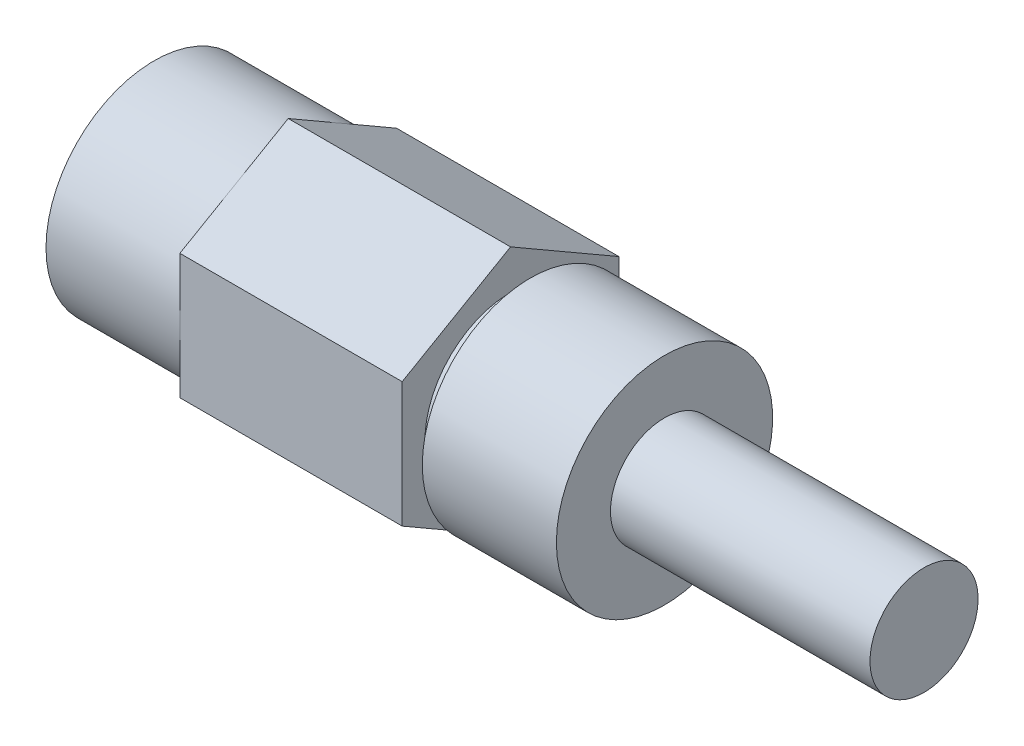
ISO-10303-21;
HEADER;
FILE_DESCRIPTION(('STEP AP214'),'2;1');
FILE_NAME('part.step','',(''),(''),'','','');
FILE_SCHEMA(('AUTOMOTIVE_DESIGN { 1 0 10303 214 1 1 1 1 }'));
ENDSEC;
DATA;
#1=APPLICATION_CONTEXT('core data for automotive mechanical design processes');
#2=APPLICATION_PROTOCOL_DEFINITION('international standard','automotive_design',2000,#1);
#3=PRODUCT_CONTEXT('',#1,'mechanical');
#4=PRODUCT('Part','Part','',(#3));
#5=PRODUCT_RELATED_PRODUCT_CATEGORY('part','',(#4));
#6=PRODUCT_DEFINITION_FORMATION('','',#4);
#7=PRODUCT_DEFINITION_CONTEXT('part definition',#1,'design');
#8=PRODUCT_DEFINITION('design','',#6,#7);
#9=PRODUCT_DEFINITION_SHAPE('','',#8);
#10=(LENGTH_UNIT() NAMED_UNIT(*) SI_UNIT(.MILLI.,.METRE.));
#11=(NAMED_UNIT(*) PLANE_ANGLE_UNIT() SI_UNIT($,.RADIAN.));
#12=(NAMED_UNIT(*) SI_UNIT($,.STERADIAN.) SOLID_ANGLE_UNIT());
#13=UNCERTAINTY_MEASURE_WITH_UNIT(LENGTH_MEASURE(1.E-05),#10,'distance_accuracy_value','');
#14=(GEOMETRIC_REPRESENTATION_CONTEXT(3) GLOBAL_UNCERTAINTY_ASSIGNED_CONTEXT((#13)) GLOBAL_UNIT_ASSIGNED_CONTEXT((#10,
#11,#12)) REPRESENTATION_CONTEXT('',''));
#15=CARTESIAN_POINT('',(0.,0.,0.));
#16=DIRECTION('',(0.,0.,1.));
#17=DIRECTION('',(1.,0.,0.));
#18=AXIS2_PLACEMENT_3D('',#15,#16,#17);
#19=CARTESIAN_POINT('',(0.,0.,0.));
#20=DIRECTION('',(-1.,0.,0.));
#21=DIRECTION('',(0.,0.,1.));
#22=AXIS2_PLACEMENT_3D('',#19,#20,#21);
#23=CYLINDRICAL_SURFACE('',#22,6.35);
#24=CARTESIAN_POINT('',(22.098,0.,0.));
#25=DIRECTION('',(-1.,0.,0.));
#26=DIRECTION('',(0.,0.,1.));
#27=AXIS2_PLACEMENT_3D('',#24,#25,#26);
#28=CIRCLE('',#27,6.35);
#29=CARTESIAN_POINT('',(22.098,0.,6.35));
#30=VERTEX_POINT('',#29);
#31=EDGE_CURVE('E154',#30,#30,#28,.T.);
#32=ORIENTED_EDGE('',*,*,#31,.F.);
#33=EDGE_LOOP('',(#32));
#34=FACE_BOUND('',#33,.T.);
#35=CARTESIAN_POINT('',(29.972,0.,0.));
#36=DIRECTION('',(-1.,0.,0.));
#37=DIRECTION('',(0.,0.,1.));
#38=AXIS2_PLACEMENT_3D('',#35,#36,#37);
#39=CIRCLE('',#38,6.35);
#40=CARTESIAN_POINT('',(29.972,0.,6.35));
#41=VERTEX_POINT('',#40);
#42=EDGE_CURVE('E166',#41,#41,#39,.T.);
#43=ORIENTED_EDGE('',*,*,#42,.T.);
#44=EDGE_LOOP('',(#43));
#45=FACE_BOUND('',#44,.T.);
#46=ADVANCED_FACE('F38',(#34,#45),#23,.T.);
#47=CARTESIAN_POINT('',(29.972,6.35,0.));
#48=DIRECTION('',(-1.,0.,0.));
#49=DIRECTION('',(0.,0.,1.));
#50=AXIS2_PLACEMENT_3D('',#47,#48,#49);
#51=PLANE('',#50);
#52=ORIENTED_EDGE('',*,*,#42,.F.);
#53=EDGE_LOOP('',(#52));
#54=FACE_BOUND('',#53,.T.);
#55=CARTESIAN_POINT('',(29.972,0.,0.));
#56=DIRECTION('',(-1.,0.,0.));
#57=DIRECTION('',(0.,0.,1.));
#58=AXIS2_PLACEMENT_3D('',#55,#56,#57);
#59=CIRCLE('',#58,3.175);
#60=CARTESIAN_POINT('',(29.972,0.,3.175));
#61=VERTEX_POINT('',#60);
#62=EDGE_CURVE('E162',#61,#61,#59,.T.);
#63=ORIENTED_EDGE('',*,*,#62,.T.);
#64=EDGE_LOOP('',(#63));
#65=FACE_BOUND('',#64,.T.);
#66=ADVANCED_FACE('F237',(#54,#65),#51,.F.);
#67=CARTESIAN_POINT('',(0.,0.,0.));
#68=DIRECTION('',(-1.,0.,0.));
#69=DIRECTION('',(0.,0.,1.));
#70=AXIS2_PLACEMENT_3D('',#67,#68,#69);
#71=CYLINDRICAL_SURFACE('',#70,3.175);
#72=ORIENTED_EDGE('',*,*,#62,.F.);
#73=EDGE_LOOP('',(#72));
#74=FACE_BOUND('',#73,.T.);
#75=CARTESIAN_POINT('',(45.212,0.,0.));
#76=DIRECTION('',(-1.,0.,0.));
#77=DIRECTION('',(0.,0.,1.));
#78=AXIS2_PLACEMENT_3D('',#75,#76,#77);
#79=CIRCLE('',#78,3.175);
#80=CARTESIAN_POINT('',(45.212,0.,3.175));
#81=VERTEX_POINT('',#80);
#82=EDGE_CURVE('E158',#81,#81,#79,.T.);
#83=ORIENTED_EDGE('',*,*,#82,.T.);
#84=EDGE_LOOP('',(#83));
#85=FACE_BOUND('',#84,.T.);
#86=ADVANCED_FACE('F243',(#74,#85),#71,.T.);
#87=CARTESIAN_POINT('',(45.212,3.175,0.));
#88=DIRECTION('',(-1.,0.,0.));
#89=DIRECTION('',(0.,0.,1.));
#90=AXIS2_PLACEMENT_3D('',#87,#88,#89);
#91=PLANE('',#90);
#92=ORIENTED_EDGE('',*,*,#82,.F.);
#93=EDGE_LOOP('',(#92));
#94=FACE_BOUND('',#93,.T.);
#95=ADVANCED_FACE('F251',(#94),#91,.F.);
#96=CARTESIAN_POINT('',(22.098,7.34701311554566,0.));
#97=DIRECTION('',(-1.,0.,0.));
#98=DIRECTION('',(0.,0.,1.));
#99=AXIS2_PLACEMENT_3D('',#96,#97,#98);
#100=PLANE('',#99);
#101=CARTESIAN_POINT('',(22.098,0.,0.));
#102=DIRECTION('',(1.,0.,0.));
#103=DIRECTION('',(0.,0.,-1.));
#104=AXIS2_PLACEMENT_3D('',#101,#102,#103);
#105=CIRCLE('',#104,5.0292);
#106=CARTESIAN_POINT('',(22.098,0.,-5.0292));
#107=VERTEX_POINT('',#106);
#108=EDGE_CURVE('E215',#107,#107,#105,.T.);
#109=ORIENTED_EDGE('',*,*,#108,.T.);
#110=EDGE_LOOP('',(#109));
#111=FACE_BOUND('',#110,.T.);
#112=ORIENTED_EDGE('',*,*,#31,.T.);
#113=EDGE_LOOP('',(#112));
#114=FACE_BOUND('',#113,.T.);
#115=ADVANCED_FACE('F234',(#111,#114),#100,.T.);
#116=CARTESIAN_POINT('',(28.5893612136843,0.,0.));
#117=DIRECTION('',(1.,0.,0.));
#118=DIRECTION('',(0.,0.,-1.));
#119=AXIS2_PLACEMENT_3D('',#116,#117,#118);
#120=CYLINDRICAL_SURFACE('',#119,5.0292);
#121=CARTESIAN_POINT('',(20.9296,0.,0.));
#122=DIRECTION('',(1.,0.,0.));
#123=DIRECTION('',(0.,0.,-1.));
#124=AXIS2_PLACEMENT_3D('',#121,#122,#123);
#125=CIRCLE('',#124,5.0292);
#126=CARTESIAN_POINT('',(20.9296,0.,-5.0292));
#127=VERTEX_POINT('',#126);
#128=EDGE_CURVE('E221',#127,#127,#125,.T.);
#129=ORIENTED_EDGE('',*,*,#128,.T.);
#130=EDGE_LOOP('',(#129));
#131=FACE_BOUND('',#130,.T.);
#132=ORIENTED_EDGE('',*,*,#108,.F.);
#133=EDGE_LOOP('',(#132));
#134=FACE_BOUND('',#133,.T.);
#135=ADVANCED_FACE('F226',(#131,#134),#120,.T.);
#136=CARTESIAN_POINT('',(20.9296,7.34701311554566,0.));
#137=DIRECTION('',(1.,0.,0.));
#138=DIRECTION('',(0.,0.,-1.));
#139=AXIS2_PLACEMENT_3D('',#136,#137,#138);
#140=PLANE('',#139);
#141=DIRECTION('',(0.,1.,0.));
#142=VECTOR('',#141,1.);
#143=CARTESIAN_POINT('',(20.9296,3.67350655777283,6.3627));
#144=LINE('',#143,#142);
#145=CARTESIAN_POINT('',(20.9296,-3.67350655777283,6.3627));
#146=VERTEX_POINT('',#145);
#147=CARTESIAN_POINT('',(20.9296,3.67350655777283,6.3627));
#148=VERTEX_POINT('',#147);
#149=EDGE_CURVE('E11',#146,#148,#144,.T.);
#150=ORIENTED_EDGE('',*,*,#149,.F.);
#151=DIRECTION('',(0.,0.5,0.866025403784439));
#152=VECTOR('',#151,1.);
#153=CARTESIAN_POINT('',(20.9296,-3.67350655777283,6.3627));
#154=LINE('',#153,#152);
#155=CARTESIAN_POINT('',(20.9296,-7.34701311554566,0.));
#156=VERTEX_POINT('',#155);
#157=EDGE_CURVE('E197',#156,#146,#154,.T.);
#158=ORIENTED_EDGE('',*,*,#157,.F.);
#159=DIRECTION('',(0.,-0.5,0.866025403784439));
#160=VECTOR('',#159,1.);
#161=CARTESIAN_POINT('',(20.9296,-7.34701311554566,0.));
#162=LINE('',#161,#160);
#163=CARTESIAN_POINT('',(20.9296,-3.67350655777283,-6.3627));
#164=VERTEX_POINT('',#163);
#165=EDGE_CURVE('E119',#164,#156,#162,.T.);
#166=ORIENTED_EDGE('',*,*,#165,.F.);
#167=DIRECTION('',(0.,-1.,0.));
#168=VECTOR('',#167,1.);
#169=CARTESIAN_POINT('',(20.9296,-3.67350655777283,-6.3627));
#170=LINE('',#169,#168);
#171=CARTESIAN_POINT('',(20.9296,3.67350655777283,-6.3627));
#172=VERTEX_POINT('',#171);
#173=EDGE_CURVE('E113',#172,#164,#170,.T.);
#174=ORIENTED_EDGE('',*,*,#173,.F.);
#175=DIRECTION('',(0.,-0.5,-0.866025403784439));
#176=VECTOR('',#175,1.);
#177=CARTESIAN_POINT('',(20.9296,3.67350655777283,-6.3627));
#178=LINE('',#177,#176);
#179=CARTESIAN_POINT('',(20.9296,7.34701311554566,0.));
#180=VERTEX_POINT('',#179);
#181=EDGE_CURVE('E117',#180,#172,#178,.T.);
#182=ORIENTED_EDGE('',*,*,#181,.F.);
#183=DIRECTION('',(0.,0.5,-0.866025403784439));
#184=VECTOR('',#183,1.);
#185=CARTESIAN_POINT('',(20.9296,7.34701311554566,0.));
#186=LINE('',#185,#184);
#187=EDGE_CURVE('E57',#148,#180,#186,.T.);
#188=ORIENTED_EDGE('',*,*,#187,.F.);
#189=EDGE_LOOP('',(#150,#158,#166,#174,#182,#188));
#190=FACE_BOUND('',#189,.T.);
#191=ORIENTED_EDGE('',*,*,#128,.F.);
#192=EDGE_LOOP('',(#191));
#193=FACE_BOUND('',#192,.T.);
#194=ADVANCED_FACE('F115',(#190,#193),#140,.T.);
#195=CARTESIAN_POINT('',(0.,0.,0.));
#196=DIRECTION('',(1.,0.,0.));
#197=DIRECTION('',(0.,0.,-1.));
#198=AXIS2_PLACEMENT_3D('',#195,#196,#197);
#199=PLANE('',#198);
#200=CARTESIAN_POINT('',(0.,0.,0.));
#201=DIRECTION('',(-1.,0.,0.));
#202=DIRECTION('',(0.,0.,1.));
#203=AXIS2_PLACEMENT_3D('',#200,#201,#202);
#204=CIRCLE('',#203,6.35);
#205=CARTESIAN_POINT('',(0.,0.,6.35));
#206=VERTEX_POINT('',#205);
#207=EDGE_CURVE('E47',#206,#206,#204,.T.);
#208=ORIENTED_EDGE('',*,*,#207,.T.);
#209=EDGE_LOOP('',(#208));
#210=FACE_BOUND('',#209,.T.);
#211=ADVANCED_FACE('F40',(#210),#199,.F.);
#212=CARTESIAN_POINT('',(0.,0.,0.));
#213=DIRECTION('',(-1.,0.,0.));
#214=DIRECTION('',(0.,0.,1.));
#215=AXIS2_PLACEMENT_3D('',#212,#213,#214);
#216=CYLINDRICAL_SURFACE('',#215,6.35);
#217=ORIENTED_EDGE('',*,*,#207,.F.);
#218=EDGE_LOOP('',(#217));
#219=FACE_BOUND('',#218,.T.);
#220=CARTESIAN_POINT('',(7.874,0.,0.));
#221=DIRECTION('',(-1.,0.,0.));
#222=DIRECTION('',(0.,0.,1.));
#223=AXIS2_PLACEMENT_3D('',#220,#221,#222);
#224=CIRCLE('',#223,6.35);
#225=CARTESIAN_POINT('',(7.874,0.,6.35));
#226=VERTEX_POINT('',#225);
#227=EDGE_CURVE('E170',#226,#226,#224,.T.);
#228=ORIENTED_EDGE('',*,*,#227,.T.);
#229=EDGE_LOOP('',(#228));
#230=FACE_BOUND('',#229,.T.);
#231=ADVANCED_FACE('F179',(#219,#230),#216,.T.);
#232=CARTESIAN_POINT('',(7.874,6.35,0.));
#233=DIRECTION('',(1.,0.,0.));
#234=DIRECTION('',(0.,0.,-1.));
#235=AXIS2_PLACEMENT_3D('',#232,#233,#234);
#236=PLANE('',#235);
#237=ORIENTED_EDGE('',*,*,#227,.F.);
#238=EDGE_LOOP('',(#237));
#239=FACE_BOUND('',#238,.T.);
#240=DIRECTION('',(0.,0.5,0.866025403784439));
#241=VECTOR('',#240,1.);
#242=CARTESIAN_POINT('',(7.874,-3.67350655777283,6.3627));
#243=LINE('',#242,#241);
#244=CARTESIAN_POINT('',(7.874,-7.34701311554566,0.));
#245=VERTEX_POINT('',#244);
#246=CARTESIAN_POINT('',(7.874,-3.67350655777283,6.3627));
#247=VERTEX_POINT('',#246);
#248=EDGE_CURVE('E68',#245,#247,#243,.T.);
#249=ORIENTED_EDGE('',*,*,#248,.T.);
#250=DIRECTION('',(0.,1.,0.));
#251=VECTOR('',#250,1.);
#252=CARTESIAN_POINT('',(7.874,3.67350655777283,6.3627));
#253=LINE('',#252,#251);
#254=CARTESIAN_POINT('',(7.874,3.67350655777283,6.3627));
#255=VERTEX_POINT('',#254);
#256=EDGE_CURVE('E155',#247,#255,#253,.T.);
#257=ORIENTED_EDGE('',*,*,#256,.T.);
#258=DIRECTION('',(0.,0.5,-0.866025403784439));
#259=VECTOR('',#258,1.);
#260=CARTESIAN_POINT('',(7.874,7.34701311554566,0.));
#261=LINE('',#260,#259);
#262=CARTESIAN_POINT('',(7.874,7.34701311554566,0.));
#263=VERTEX_POINT('',#262);
#264=EDGE_CURVE('E92',#255,#263,#261,.T.);
#265=ORIENTED_EDGE('',*,*,#264,.T.);
#266=DIRECTION('',(0.,-0.5,-0.866025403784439));
#267=VECTOR('',#266,1.);
#268=CARTESIAN_POINT('',(7.874,3.67350655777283,-6.3627));
#269=LINE('',#268,#267);
#270=CARTESIAN_POINT('',(7.874,3.67350655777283,-6.3627));
#271=VERTEX_POINT('',#270);
#272=EDGE_CURVE('E83',#263,#271,#269,.T.);
#273=ORIENTED_EDGE('',*,*,#272,.T.);
#274=DIRECTION('',(0.,-1.,0.));
#275=VECTOR('',#274,1.);
#276=CARTESIAN_POINT('',(7.874,-3.67350655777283,-6.3627));
#277=LINE('',#276,#275);
#278=CARTESIAN_POINT('',(7.874,-3.67350655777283,-6.3627));
#279=VERTEX_POINT('',#278);
#280=EDGE_CURVE('E133',#271,#279,#277,.T.);
#281=ORIENTED_EDGE('',*,*,#280,.T.);
#282=DIRECTION('',(0.,-0.5,0.866025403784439));
#283=VECTOR('',#282,1.);
#284=CARTESIAN_POINT('',(7.874,-7.34701311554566,0.));
#285=LINE('',#284,#283);
#286=EDGE_CURVE('E191',#279,#245,#285,.T.);
#287=ORIENTED_EDGE('',*,*,#286,.T.);
#288=EDGE_LOOP('',(#249,#257,#265,#273,#281,#287));
#289=FACE_BOUND('',#288,.T.);
#290=ADVANCED_FACE('F182',(#239,#289),#236,.F.);
#291=CARTESIAN_POINT('',(-11.5643695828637,3.67350655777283,6.3627));
#292=DIRECTION('',(0.,0.,1.));
#293=DIRECTION('',(1.,0.,0.));
#294=AXIS2_PLACEMENT_3D('',#291,#292,#293);
#295=PLANE('',#294);
#296=DIRECTION('',(1.,0.,0.));
#297=VECTOR('',#296,1.);
#298=CARTESIAN_POINT('',(-11.5643695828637,-3.67350655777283,6.3627));
#299=LINE('',#298,#297);
#300=EDGE_CURVE('E147',#247,#146,#299,.T.);
#301=ORIENTED_EDGE('',*,*,#300,.T.);
#302=ORIENTED_EDGE('',*,*,#149,.T.);
#303=DIRECTION('',(1.,0.,0.));
#304=VECTOR('',#303,1.);
#305=CARTESIAN_POINT('',(-11.5643695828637,3.67350655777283,6.3627));
#306=LINE('',#305,#304);
#307=EDGE_CURVE('E151',#255,#148,#306,.T.);
#308=ORIENTED_EDGE('',*,*,#307,.F.);
#309=ORIENTED_EDGE('',*,*,#256,.F.);
#310=EDGE_LOOP('',(#301,#302,#308,#309));
#311=FACE_BOUND('',#310,.T.);
#312=ADVANCED_FACE('F187',(#311),#295,.T.);
#313=CARTESIAN_POINT('',(-11.5643695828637,-3.67350655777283,6.3627));
#314=DIRECTION('',(0.,-0.866025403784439,0.5));
#315=DIRECTION('',(0.,-0.5,-0.866025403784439));
#316=AXIS2_PLACEMENT_3D('',#313,#314,#315);
#317=PLANE('',#316);
#318=DIRECTION('',(1.,0.,0.));
#319=VECTOR('',#318,1.);
#320=CARTESIAN_POINT('',(-11.5643695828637,-7.34701311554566,0.));
#321=LINE('',#320,#319);
#322=EDGE_CURVE('E141',#245,#156,#321,.T.);
#323=ORIENTED_EDGE('',*,*,#322,.T.);
#324=ORIENTED_EDGE('',*,*,#157,.T.);
#325=ORIENTED_EDGE('',*,*,#300,.F.);
#326=ORIENTED_EDGE('',*,*,#248,.F.);
#327=EDGE_LOOP('',(#323,#324,#325,#326));
#328=FACE_BOUND('',#327,.T.);
#329=ADVANCED_FACE('F196',(#328),#317,.T.);
#330=CARTESIAN_POINT('',(-11.5643695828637,-7.34701311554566,0.));
#331=DIRECTION('',(0.,-0.866025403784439,-0.5));
#332=DIRECTION('',(0.,0.5,-0.866025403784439));
#333=AXIS2_PLACEMENT_3D('',#330,#331,#332);
#334=PLANE('',#333);
#335=DIRECTION('',(1.,0.,0.));
#336=VECTOR('',#335,1.);
#337=CARTESIAN_POINT('',(-11.5643695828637,-3.67350655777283,-6.3627));
#338=LINE('',#337,#336);
#339=EDGE_CURVE('E135',#279,#164,#338,.T.);
#340=ORIENTED_EDGE('',*,*,#339,.T.);
#341=ORIENTED_EDGE('',*,*,#165,.T.);
#342=ORIENTED_EDGE('',*,*,#322,.F.);
#343=ORIENTED_EDGE('',*,*,#286,.F.);
#344=EDGE_LOOP('',(#340,#341,#342,#343));
#345=FACE_BOUND('',#344,.T.);
#346=ADVANCED_FACE('F211',(#345),#334,.T.);
#347=CARTESIAN_POINT('',(-11.5643695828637,-3.67350655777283,-6.3627));
#348=DIRECTION('',(0.,0.,-1.));
#349=DIRECTION('',(-1.,0.,0.));
#350=AXIS2_PLACEMENT_3D('',#347,#348,#349);
#351=PLANE('',#350);
#352=DIRECTION('',(1.,0.,0.));
#353=VECTOR('',#352,1.);
#354=CARTESIAN_POINT('',(-11.5643695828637,3.67350655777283,-6.3627));
#355=LINE('',#354,#353);
#356=EDGE_CURVE('E127',#271,#172,#355,.T.);
#357=ORIENTED_EDGE('',*,*,#356,.T.);
#358=ORIENTED_EDGE('',*,*,#173,.T.);
#359=ORIENTED_EDGE('',*,*,#339,.F.);
#360=ORIENTED_EDGE('',*,*,#280,.F.);
#361=EDGE_LOOP('',(#357,#358,#359,#360));
#362=FACE_BOUND('',#361,.T.);
#363=ADVANCED_FACE('F132',(#362),#351,.T.);
#364=CARTESIAN_POINT('',(-11.5643695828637,3.67350655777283,-6.3627));
#365=DIRECTION('',(0.,0.866025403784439,-0.5));
#366=DIRECTION('',(0.,0.5,0.866025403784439));
#367=AXIS2_PLACEMENT_3D('',#364,#365,#366);
#368=PLANE('',#367);
#369=DIRECTION('',(1.,0.,0.));
#370=VECTOR('',#369,1.);
#371=CARTESIAN_POINT('',(-11.5643695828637,7.34701311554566,0.));
#372=LINE('',#371,#370);
#373=EDGE_CURVE('E128',#263,#180,#372,.T.);
#374=ORIENTED_EDGE('',*,*,#373,.T.);
#375=ORIENTED_EDGE('',*,*,#181,.T.);
#376=ORIENTED_EDGE('',*,*,#356,.F.);
#377=ORIENTED_EDGE('',*,*,#272,.F.);
#378=EDGE_LOOP('',(#374,#375,#376,#377));
#379=FACE_BOUND('',#378,.T.);
#380=ADVANCED_FACE('F126',(#379),#368,.T.);
#381=CARTESIAN_POINT('',(-11.5643695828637,7.34701311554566,0.));
#382=DIRECTION('',(0.,0.866025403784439,0.5));
#383=DIRECTION('',(0.,-0.5,0.866025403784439));
#384=AXIS2_PLACEMENT_3D('',#381,#382,#383);
#385=PLANE('',#384);
#386=ORIENTED_EDGE('',*,*,#307,.T.);
#387=ORIENTED_EDGE('',*,*,#187,.T.);
#388=ORIENTED_EDGE('',*,*,#373,.F.);
#389=ORIENTED_EDGE('',*,*,#264,.F.);
#390=EDGE_LOOP('',(#386,#387,#388,#389));
#391=FACE_BOUND('',#390,.T.);
#392=ADVANCED_FACE('F199',(#391),#385,.T.);
#393=CLOSED_SHELL('',(#46,#66,#86,#95,#115,#135,#194,#211,#231,#290,#312,#329,#346,#363,#380,#392));
#394=MANIFOLD_SOLID_BREP('B2',#393);
#395=ADVANCED_BREP_SHAPE_REPRESENTATION('',(#18,#394),#14);
#396=SHAPE_DEFINITION_REPRESENTATION(#9,#395);
ENDSEC;
END-ISO-10303-21;
